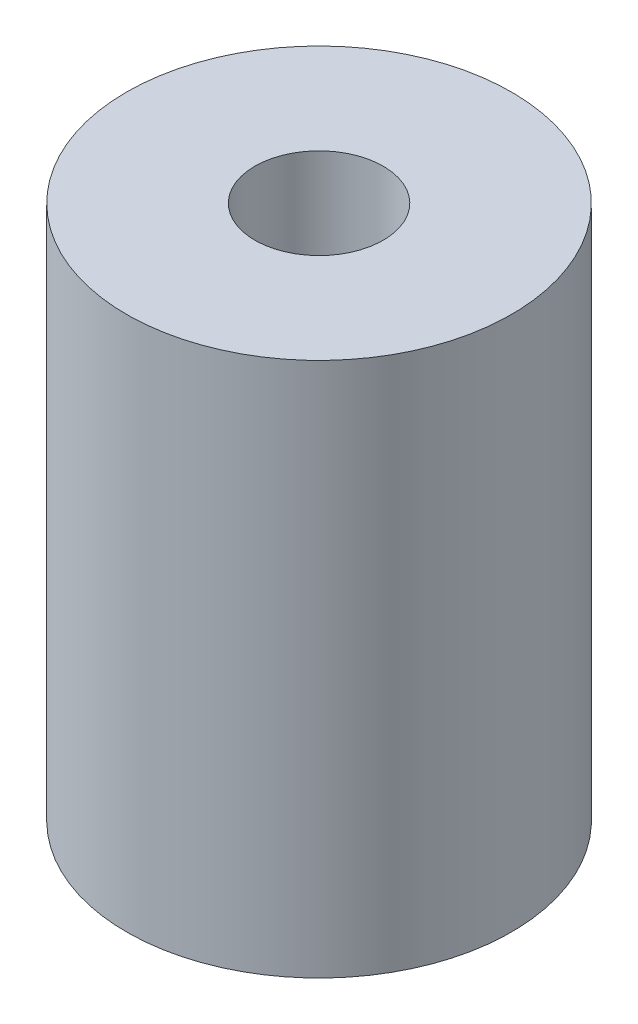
ISO-10303-21;
HEADER;
FILE_DESCRIPTION(('STEP AP214'),'2;1');
FILE_NAME('part.step','',(''),(''),'','','');
FILE_SCHEMA(('AUTOMOTIVE_DESIGN { 1 0 10303 214 1 1 1 1 }'));
ENDSEC;
DATA;
#1=APPLICATION_CONTEXT('core data for automotive mechanical design processes');
#2=APPLICATION_PROTOCOL_DEFINITION('international standard','automotive_design',2000,#1);
#3=PRODUCT_CONTEXT('',#1,'mechanical');
#4=PRODUCT('Part','Part','',(#3));
#5=PRODUCT_RELATED_PRODUCT_CATEGORY('part','',(#4));
#6=PRODUCT_DEFINITION_FORMATION('','',#4);
#7=PRODUCT_DEFINITION_CONTEXT('part definition',#1,'design');
#8=PRODUCT_DEFINITION('design','',#6,#7);
#9=PRODUCT_DEFINITION_SHAPE('','',#8);
#10=(LENGTH_UNIT() NAMED_UNIT(*) SI_UNIT(.MILLI.,.METRE.));
#11=(NAMED_UNIT(*) PLANE_ANGLE_UNIT() SI_UNIT($,.RADIAN.));
#12=(NAMED_UNIT(*) SI_UNIT($,.STERADIAN.) SOLID_ANGLE_UNIT());
#13=UNCERTAINTY_MEASURE_WITH_UNIT(LENGTH_MEASURE(1.E-05),#10,'distance_accuracy_value','');
#14=(GEOMETRIC_REPRESENTATION_CONTEXT(3) GLOBAL_UNCERTAINTY_ASSIGNED_CONTEXT((#13)) GLOBAL_UNIT_ASSIGNED_CONTEXT((#10,
#11,#12)) REPRESENTATION_CONTEXT('',''));
#15=CARTESIAN_POINT('',(0.,0.,0.));
#16=DIRECTION('',(0.,0.,1.));
#17=DIRECTION('',(1.,0.,0.));
#18=AXIS2_PLACEMENT_3D('',#15,#16,#17);
#19=CARTESIAN_POINT('',(0.,25.,0.));
#20=DIRECTION('',(0.,1.,0.));
#21=DIRECTION('',(-1.,0.,0.));
#22=AXIS2_PLACEMENT_3D('',#19,#20,#21);
#23=CYLINDRICAL_SURFACE('',#22,9.);
#24=CARTESIAN_POINT('',(0.,25.,0.));
#25=DIRECTION('',(0.,1.,0.));
#26=DIRECTION('',(-1.,0.,0.));
#27=AXIS2_PLACEMENT_3D('',#24,#25,#26);
#28=CIRCLE('',#27,9.);
#29=CARTESIAN_POINT('',(-9.,25.,0.));
#30=VERTEX_POINT('',#29);
#31=EDGE_CURVE('E10',#30,#30,#28,.T.);
#32=ORIENTED_EDGE('',*,*,#31,.F.);
#33=EDGE_LOOP('',(#32));
#34=FACE_BOUND('',#33,.T.);
#35=CARTESIAN_POINT('',(0.,0.,0.));
#36=DIRECTION('',(0.,1.,0.));
#37=DIRECTION('',(-1.,0.,0.));
#38=AXIS2_PLACEMENT_3D('',#35,#36,#37);
#39=CIRCLE('',#38,9.);
#40=CARTESIAN_POINT('',(-9.,0.,0.));
#41=VERTEX_POINT('',#40);
#42=EDGE_CURVE('E48',#41,#41,#39,.T.);
#43=ORIENTED_EDGE('',*,*,#42,.T.);
#44=EDGE_LOOP('',(#43));
#45=FACE_BOUND('',#44,.T.);
#46=ADVANCED_FACE('F34',(#34,#45),#23,.T.);
#47=CARTESIAN_POINT('',(3.,25.,0.));
#48=DIRECTION('',(0.,-1.,0.));
#49=DIRECTION('',(1.,0.,0.));
#50=AXIS2_PLACEMENT_3D('',#47,#48,#49);
#51=PLANE('',#50);
#52=CARTESIAN_POINT('',(0.,25.,0.));
#53=DIRECTION('',(0.,1.,0.));
#54=DIRECTION('',(-1.,0.,0.));
#55=AXIS2_PLACEMENT_3D('',#52,#53,#54);
#56=CIRCLE('',#55,2.99999999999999);
#57=CARTESIAN_POINT('',(-2.99999999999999,25.,0.));
#58=VERTEX_POINT('',#57);
#59=EDGE_CURVE('E40',#58,#58,#56,.T.);
#60=ORIENTED_EDGE('',*,*,#59,.F.);
#61=EDGE_LOOP('',(#60));
#62=FACE_BOUND('',#61,.T.);
#63=ORIENTED_EDGE('',*,*,#31,.T.);
#64=EDGE_LOOP('',(#63));
#65=FACE_BOUND('',#64,.T.);
#66=ADVANCED_FACE('F63',(#62,#65),#51,.F.);
#67=CARTESIAN_POINT('',(0.,25.,0.));
#68=DIRECTION('',(0.,1.,0.));
#69=DIRECTION('',(-1.,0.,0.));
#70=AXIS2_PLACEMENT_3D('',#67,#68,#69);
#71=CYLINDRICAL_SURFACE('',#70,3.);
#72=CARTESIAN_POINT('',(0.,0.,0.));
#73=DIRECTION('',(0.,1.,0.));
#74=DIRECTION('',(-1.,0.,0.));
#75=AXIS2_PLACEMENT_3D('',#72,#73,#74);
#76=CIRCLE('',#75,3.);
#77=CARTESIAN_POINT('',(-3.,0.,0.));
#78=VERTEX_POINT('',#77);
#79=EDGE_CURVE('E44',#78,#78,#76,.T.);
#80=ORIENTED_EDGE('',*,*,#79,.F.);
#81=EDGE_LOOP('',(#80));
#82=FACE_BOUND('',#81,.T.);
#83=ORIENTED_EDGE('',*,*,#59,.T.);
#84=EDGE_LOOP('',(#83));
#85=FACE_BOUND('',#84,.T.);
#86=ADVANCED_FACE('F58',(#82,#85),#71,.F.);
#87=CARTESIAN_POINT('',(3.,0.,0.));
#88=DIRECTION('',(0.,1.,0.));
#89=DIRECTION('',(-1.,0.,0.));
#90=AXIS2_PLACEMENT_3D('',#87,#88,#89);
#91=PLANE('',#90);
#92=ORIENTED_EDGE('',*,*,#42,.F.);
#93=EDGE_LOOP('',(#92));
#94=FACE_BOUND('',#93,.T.);
#95=ORIENTED_EDGE('',*,*,#79,.T.);
#96=EDGE_LOOP('',(#95));
#97=FACE_BOUND('',#96,.T.);
#98=ADVANCED_FACE('F55',(#94,#97),#91,.F.);
#99=CLOSED_SHELL('',(#46,#66,#86,#98));
#100=MANIFOLD_SOLID_BREP('B2',#99);
#101=ADVANCED_BREP_SHAPE_REPRESENTATION('',(#18,#100),#14);
#102=SHAPE_DEFINITION_REPRESENTATION(#9,#101);
ENDSEC;
END-ISO-10303-21;
